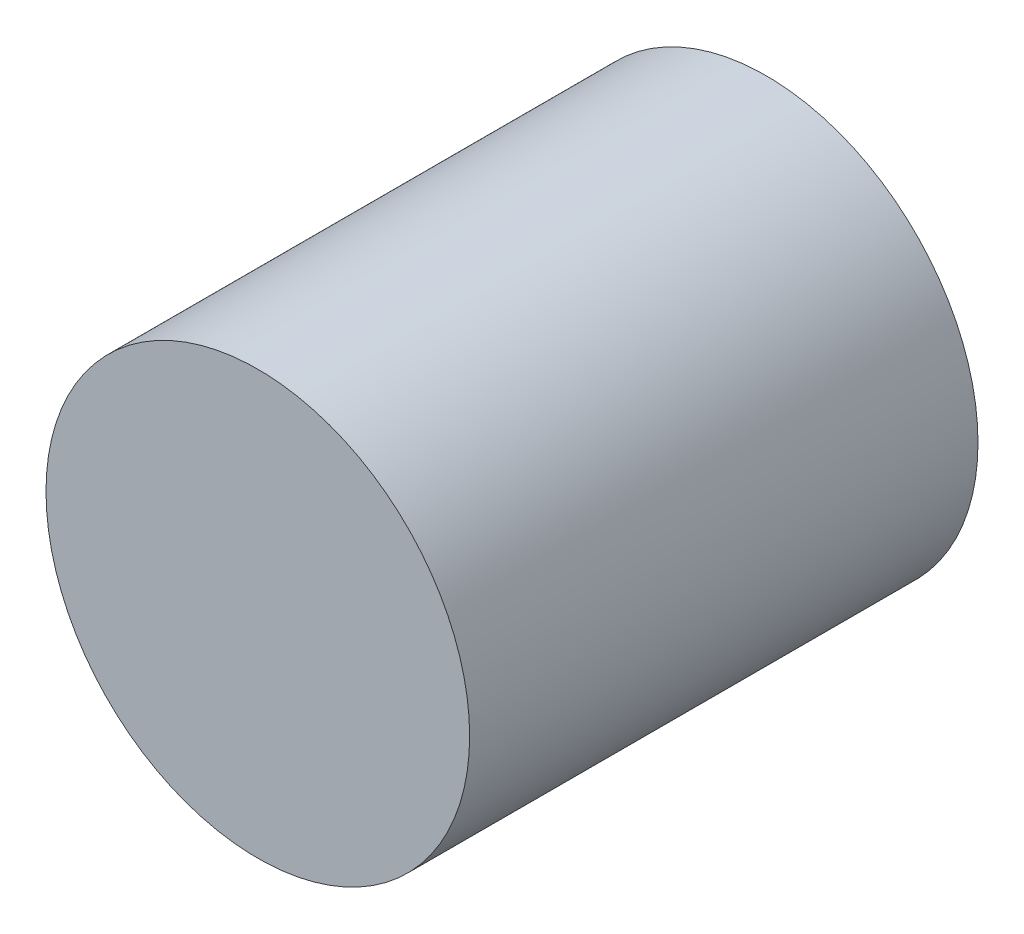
from build123d import *

# Parameters (mm, degrees)
SKETCH1_R           = 12.5
BOSS_EXTRUDE1_DEPTH = 15


with BuildPart() as part:
    # Sketch1 → Boss-Extrude1 (new, symmetric)
    with BuildSketch(Plane.XY):
        Circle(SKETCH1_R)
    extrude(amount=BOSS_EXTRUDE1_DEPTH, both=True)


solid = part.part
